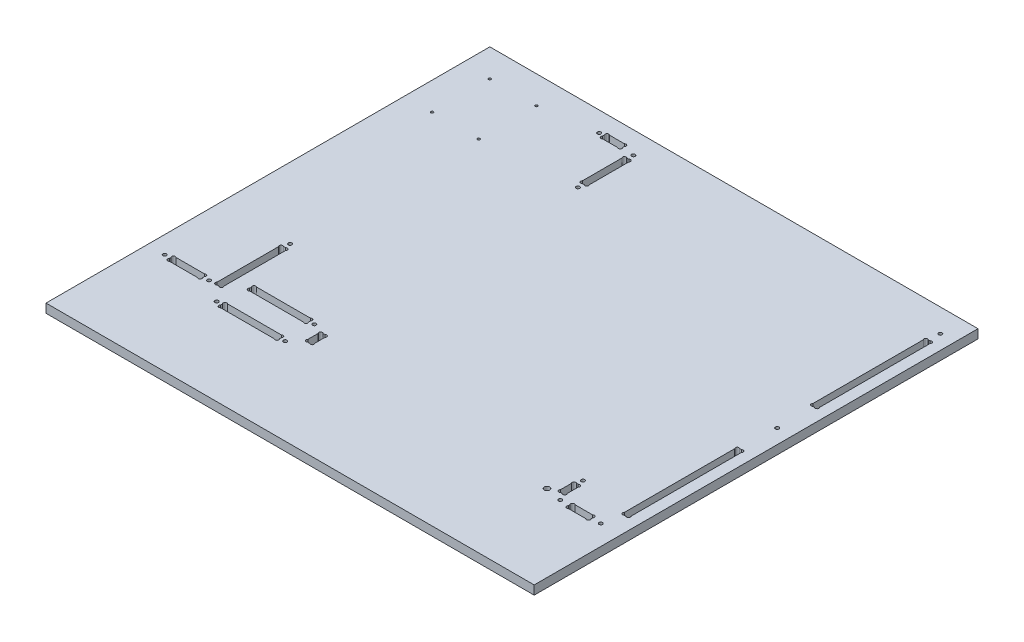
from build123d import *

# Parameters (mm, degrees)
ESQUISSE1_W        = 440
ESQUISSE1_H        = 400
ESQUISSE1_R        = 1.6
ESQUISSE1_R_2      = 2.45
ESQUISSE1_R_3      = 1.1
BOSS_EXTRU_1_DEPTH = 8


with BuildPart() as part:
    # Esquisse1 → Boss.-Extru.1 (new body)
    with BuildSketch(Plane(origin=(0, 0, 0), x_dir=(1, 0, 0), z_dir=(0, 1, 0))):
        with Locations((215, 200)):
            Rectangle(ESQUISSE1_W, ESQUISSE1_H)
        with Locations(Location((417, 78, 0), (0, 0, 90))):
            Circle(ESQUISSE1_R, mode=Mode.SUBTRACT)
        with Locations(Location((375.5, 103.4, 0), (0, 0, 270))):
            Circle(ESQUISSE1_R, mode=Mode.SUBTRACT)
        with Locations(Location((380.5, 78, 0), (0, 0, 270))):
            Circle(ESQUISSE1_R, mode=Mode.SUBTRACT)
        with Locations(Location((422, 379, 0), (0, 0, 270))):
            Circle(ESQUISSE1_R, mode=Mode.SUBTRACT)
        with Locations(Location((422, 232, 0), (0, 0, 270))):
            Circle(ESQUISSE1_R, mode=Mode.SUBTRACT)
        with Locations(Location((111.5, 382, 0), (0, 0, 90))):
            Circle(ESQUISSE1_R, mode=Mode.SUBTRACT)
        with Locations(Location((144.4, 330, 0), (0, 0, 270))):
            Circle(ESQUISSE1_R, mode=Mode.SUBTRACT)
        with Locations(Location((144.4, 380, 0), (0, 0, 90))):
            Circle(ESQUISSE1_R, mode=Mode.SUBTRACT)
        with Locations(Location((10.75, 91.2, 0), (0, 0, 270))):
            Circle(ESQUISSE1_R, mode=Mode.SUBTRACT)
        with Locations(Location((50.75, 91.2, 0), (0, 0, 90))):
            Circle(ESQUISSE1_R, mode=Mode.SUBTRACT)
        with Locations(Location((58.85, 156.2, 0), (0, 0, 90))):
            Circle(ESQUISSE1_R, mode=Mode.SUBTRACT)
        with Locations(Location((132.5, 104.3, 0), (0, 0, 270))):
            Circle(ESQUISSE1_R, mode=Mode.SUBTRACT)
        with Locations(Location((70.75, 78.1, 0), (0, 0, 270))):
            Circle(ESQUISSE1_R, mode=Mode.SUBTRACT)
        with Locations(Location((132.5, 78.1, 0), (0, 0, 90))):
            Circle(ESQUISSE1_R, mode=Mode.SUBTRACT)
        with Locations(Location((365.5, 81, 0), (0, 0, 270))):
            Circle(ESQUISSE1_R_2, mode=Mode.SUBTRACT)
        with Locations(Location((20, 375, 0), (0, 0, 270))):
            Circle(ESQUISSE1_R_3, mode=Mode.SUBTRACT)
        with Locations(Location((62, 375, 0), (0, 0, 270))):
            Circle(ESQUISSE1_R_3, mode=Mode.SUBTRACT)
        with Locations(Location((62, 323, 0), (0, 0, 270))):
            Circle(ESQUISSE1_R_3, mode=Mode.SUBTRACT)
        with Locations(Location((20, 323, 0), (0, 0, 270))):
            Circle(ESQUISSE1_R_3, mode=Mode.SUBTRACT)
        with BuildLine():
            Line((409, 78.7372583), (409, 77.2627417))
            ThreePointArc((409, 77.2627417), (409, 75), (406.7372583, 75))
            Line((406.7372583, 75), (390.7627417, 75))
            ThreePointArc((390.7627417, 75), (388.5, 75), (388.5, 77.2627417))
            Line((388.5, 77.2627417), (388.5, 78.7372583))
            ThreePointArc((388.5, 78.7372583), (388.5, 81), (390.7627417, 81))
            Line((390.7627417, 81), (406.7372583, 81))
            ThreePointArc((406.7372583, 81), (409, 81), (409, 78.7372583))
        make_face(mode=Mode.SUBTRACT)
        with BuildLine():
            Line((421.2627417, 265), (422.7372583, 265))
            ThreePointArc((422.7372583, 265), (425, 265), (425, 267.2627417))
            Line((425, 267.2627417), (425, 366.7372583))
            ThreePointArc((425, 366.7372583), (425, 369), (422.7372583, 369))
            Line((422.7372583, 369), (421.2627417, 369))
            ThreePointArc((421.2627417, 369), (419, 369), (419, 366.7372583))
            Line((419, 366.7372583), (419, 267.2627417))
            ThreePointArc((419, 267.2627417), (419, 265), (421.2627417, 265))
        make_face(mode=Mode.SUBTRACT)
        with BuildLine():
            Line((425, 196.7372583), (425, 97.2627417))
            ThreePointArc((425, 97.2627417), (425, 95), (422.7372583, 95))
            Line((422.7372583, 95), (421.2627417, 95))
            ThreePointArc((421.2627417, 95), (419, 95), (419, 97.2627417))
            Line((419, 97.2627417), (419, 196.7372583))
            ThreePointArc((419, 196.7372583), (419, 199), (421.2627417, 199))
            Line((421.2627417, 199), (422.7372583, 199))
            ThreePointArc((422.7372583, 199), (425, 199), (425, 196.7372583))
        make_face(mode=Mode.SUBTRACT)
        with BuildLine():
            Line((374.7627417, 84), (376.2372583, 84))
            ThreePointArc((376.2372583, 84), (378.5, 84), (378.5, 86.2627417))
            Line((378.5, 86.2627417), (378.5, 96.1372583))
            ThreePointArc((378.5, 96.1372583), (378.5, 98.4), (376.2372583, 98.4))
            Line((376.2372583, 98.4), (374.7627417, 98.4))
            ThreePointArc((374.7627417, 98.4), (372.5, 98.4), (372.5, 96.1372583))
            Line((372.5, 96.1372583), (372.5, 86.2627417))
            ThreePointArc((372.5, 86.2627417), (372.5, 84), (374.7627417, 84))
        make_face(mode=Mode.SUBTRACT)
        with BuildLine():
            Line((117.7627417, 385), (131.2372583, 385))
            ThreePointArc((131.2372583, 385), (133.5, 385), (133.5, 382.7372583))
            Line((133.5, 382.7372583), (133.5, 381.2627417))
            ThreePointArc((133.5, 381.2627417), (133.5, 379), (131.2372583, 379))
            Line((131.2372583, 379), (117.7627417, 379))
            ThreePointArc((117.7627417, 379), (115.5, 379), (115.5, 381.2627417))
            Line((115.5, 381.2627417), (115.5, 382.7372583))
            ThreePointArc((115.5, 382.7372583), (115.5, 385), (117.7627417, 385))
        make_face(mode=Mode.SUBTRACT)
        with BuildLine():
            Line((147.5, 337.2627417), (147.5, 372.7372583))
            ThreePointArc((147.5, 372.7372583), (147.5, 375), (145.2372583, 375))
            Line((145.2372583, 375), (143.5627417, 375))
            ThreePointArc((143.5627417, 375), (141.3, 375), (141.3, 372.7372583))
            Line((141.3, 372.7372583), (141.3, 337.2627417))
            ThreePointArc((141.3, 337.2627417), (141.3, 335), (143.5627417, 335))
            Line((143.5627417, 335), (145.2372583, 335))
            ThreePointArc((145.2372583, 335), (147.5, 335), (147.5, 337.2627417))
        make_face(mode=Mode.SUBTRACT)
        with BuildLine():
            Line((43.4872583, 94.2), (18.0127417, 94.2))
            ThreePointArc((18.0127417, 94.2), (15.75, 94.2), (15.75, 91.9372583))
            Line((15.75, 91.9372583), (15.75, 90.4627417))
            ThreePointArc((15.75, 90.4627417), (15.75, 88.2), (18.0127417, 88.2))
            Line((18.0127417, 88.2), (43.4872583, 88.2))
            ThreePointArc((43.4872583, 88.2), (45.75, 88.2), (45.75, 90.4627417))
            Line((45.75, 90.4627417), (45.75, 91.9372583))
            ThreePointArc((45.75, 91.9372583), (45.75, 94.2), (43.4872583, 94.2))
        make_face(mode=Mode.SUBTRACT)
        with BuildLine():
            Line((55.75, 93.4627417), (55.75, 148.9372583))
            ThreePointArc((55.75, 148.9372583), (55.75, 151.2), (58.0127417, 151.2))
            Line((58.0127417, 151.2), (59.6872583, 151.2))
            ThreePointArc((59.6872583, 151.2), (61.95, 151.2), (61.95, 148.9372583))
            Line((61.95, 148.9372583), (61.95, 93.4627417))
            ThreePointArc((61.95, 93.4627417), (61.95, 91.2), (59.6872583, 91.2))
            Line((59.6872583, 91.2), (58.0127417, 91.2))
            ThreePointArc((58.0127417, 91.2), (55.75, 91.2), (55.75, 93.4627417))
        make_face(mode=Mode.SUBTRACT)
        with BuildLine():
            Line((75.15, 103.4627417), (75.15, 105.1372583))
            ThreePointArc((75.15, 105.1372583), (75.15, 107.4), (77.4127417, 107.4))
            Line((77.4127417, 107.4), (125.8372583, 107.4))
            ThreePointArc((125.8372583, 107.4), (128.1, 107.4), (128.1, 105.1372583))
            Line((128.1, 105.1372583), (128.1, 103.4627417))
            ThreePointArc((128.1, 103.4627417), (128.1, 101.2), (125.8372583, 101.2))
            Line((125.8372583, 101.2), (77.4127417, 101.2))
            ThreePointArc((77.4127417, 101.2), (75.15, 101.2), (75.15, 103.4627417))
        make_face(mode=Mode.SUBTRACT)
        with BuildLine():
            Line((125.8372583, 81.2), (77.4127417, 81.2))
            ThreePointArc((77.4127417, 81.2), (75.15, 81.2), (75.15, 78.9372583))
            Line((75.15, 78.9372583), (75.15, 77.2627417))
            ThreePointArc((75.15, 77.2627417), (75.15, 75), (77.4127417, 75))
            Line((77.4127417, 75), (125.8372583, 75))
            ThreePointArc((125.8372583, 75), (128.1, 75), (128.1, 77.2627417))
            Line((128.1, 77.2627417), (128.1, 78.9372583))
            ThreePointArc((128.1, 78.9372583), (128.1, 81.2), (125.8372583, 81.2))
        make_face(mode=Mode.SUBTRACT)
        with BuildLine():
            Line((145.2372583, 101.2), (143.5627417, 101.2))
            ThreePointArc((143.5627417, 101.2), (141.3, 101.2), (141.3, 98.9372583))
            Line((141.3, 98.9372583), (141.3, 89.6627417))
            ThreePointArc((141.3, 89.6627417), (141.3, 87.4), (143.5627417, 87.4))
            Line((143.5627417, 87.4), (145.2372583, 87.4))
            ThreePointArc((145.2372583, 87.4), (147.5, 87.4), (147.5, 89.6627417))
            Line((147.5, 89.6627417), (147.5, 98.9372583))
            ThreePointArc((147.5, 98.9372583), (147.5, 101.2), (145.2372583, 101.2))
        make_face(mode=Mode.SUBTRACT)
    extrude(amount=BOSS_EXTRU_1_DEPTH)


solid = part.part
